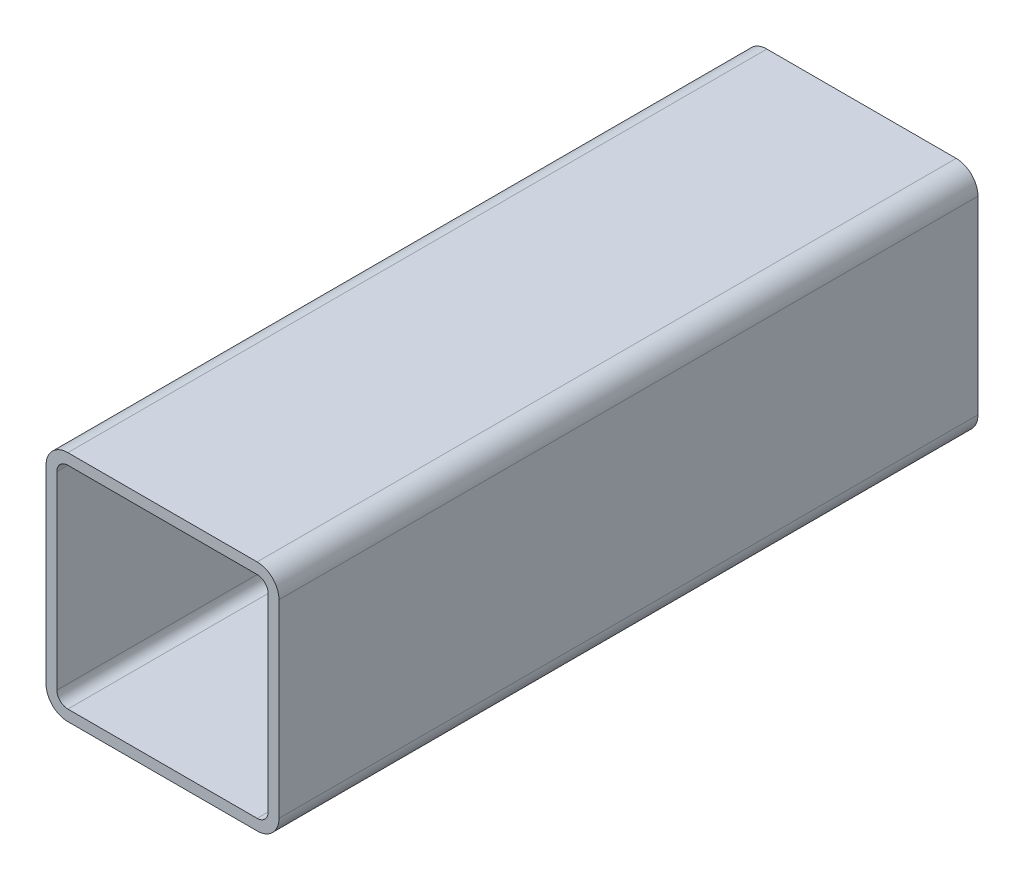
ISO-10303-21;
HEADER;
FILE_DESCRIPTION(('STEP AP214'),'2;1');
FILE_NAME('part.step','',(''),(''),'','','');
FILE_SCHEMA(('AUTOMOTIVE_DESIGN { 1 0 10303 214 1 1 1 1 }'));
ENDSEC;
DATA;
#1=APPLICATION_CONTEXT('core data for automotive mechanical design processes');
#2=APPLICATION_PROTOCOL_DEFINITION('international standard','automotive_design',2000,#1);
#3=PRODUCT_CONTEXT('',#1,'mechanical');
#4=PRODUCT('Part','Part','',(#3));
#5=PRODUCT_RELATED_PRODUCT_CATEGORY('part','',(#4));
#6=PRODUCT_DEFINITION_FORMATION('','',#4);
#7=PRODUCT_DEFINITION_CONTEXT('part definition',#1,'design');
#8=PRODUCT_DEFINITION('design','',#6,#7);
#9=PRODUCT_DEFINITION_SHAPE('','',#8);
#10=(LENGTH_UNIT() NAMED_UNIT(*) SI_UNIT(.MILLI.,.METRE.));
#11=(NAMED_UNIT(*) PLANE_ANGLE_UNIT() SI_UNIT($,.RADIAN.));
#12=(NAMED_UNIT(*) SI_UNIT($,.STERADIAN.) SOLID_ANGLE_UNIT());
#13=UNCERTAINTY_MEASURE_WITH_UNIT(LENGTH_MEASURE(1.E-05),#10,'distance_accuracy_value','');
#14=(GEOMETRIC_REPRESENTATION_CONTEXT(3) GLOBAL_UNCERTAINTY_ASSIGNED_CONTEXT((#13)) GLOBAL_UNIT_ASSIGNED_CONTEXT((#10,
#11,#12)) REPRESENTATION_CONTEXT('',''));
#15=CARTESIAN_POINT('',(0.,0.,0.));
#16=DIRECTION('',(0.,0.,1.));
#17=DIRECTION('',(1.,0.,0.));
#18=AXIS2_PLACEMENT_3D('',#15,#16,#17);
#19=CARTESIAN_POINT('',(11.2001778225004,94.1327651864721,304.8));
#20=DIRECTION('',(0.,0.,1.));
#21=DIRECTION('',(1.,0.,0.));
#22=AXIS2_PLACEMENT_3D('',#19,#20,#21);
#23=PLANE('',#22);
#24=CARTESIAN_POINT('',(11.2001778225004,94.1327651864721,304.8));
#25=DIRECTION('',(0.,0.,1.));
#26=DIRECTION('',(1.,0.,0.));
#27=AXIS2_PLACEMENT_3D('',#24,#25,#26);
#28=CIRCLE('',#27,9.52499999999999);
#29=CARTESIAN_POINT('',(11.2001778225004,103.657765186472,304.8));
#30=VERTEX_POINT('',#29);
#31=CARTESIAN_POINT('',(1.67517782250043,94.1327651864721,304.8));
#32=VERTEX_POINT('',#31);
#33=EDGE_CURVE('E211',#30,#32,#28,.T.);
#34=ORIENTED_EDGE('',*,*,#33,.T.);
#35=DIRECTION('',(0.,-1.,0.));
#36=VECTOR('',#35,1.);
#37=CARTESIAN_POINT('',(1.67517782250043,11.5827651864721,304.8));
#38=LINE('',#37,#36);
#39=CARTESIAN_POINT('',(1.67517782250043,11.5827651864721,304.8));
#40=VERTEX_POINT('',#39);
#41=EDGE_CURVE('E214',#32,#40,#38,.T.);
#42=ORIENTED_EDGE('',*,*,#41,.T.);
#43=CARTESIAN_POINT('',(11.2001778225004,11.5827651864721,304.8));
#44=DIRECTION('',(0.,0.,1.));
#45=DIRECTION('',(1.,0.,0.));
#46=AXIS2_PLACEMENT_3D('',#43,#44,#45);
#47=CIRCLE('',#46,9.52499999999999);
#48=CARTESIAN_POINT('',(11.2001778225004,2.05776518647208,304.8));
#49=VERTEX_POINT('',#48);
#50=EDGE_CURVE('E217',#40,#49,#47,.T.);
#51=ORIENTED_EDGE('',*,*,#50,.T.);
#52=DIRECTION('',(1.,0.,0.));
#53=VECTOR('',#52,1.);
#54=CARTESIAN_POINT('',(93.7501778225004,2.05776518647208,304.8));
#55=LINE('',#54,#53);
#56=CARTESIAN_POINT('',(93.7501778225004,2.05776518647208,304.8));
#57=VERTEX_POINT('',#56);
#58=EDGE_CURVE('E219',#49,#57,#55,.T.);
#59=ORIENTED_EDGE('',*,*,#58,.T.);
#60=CARTESIAN_POINT('',(93.7501778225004,11.5827651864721,304.8));
#61=DIRECTION('',(0.,0.,1.));
#62=DIRECTION('',(1.,0.,0.));
#63=AXIS2_PLACEMENT_3D('',#60,#61,#62);
#64=CIRCLE('',#63,9.525);
#65=CARTESIAN_POINT('',(103.2751778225,11.5827651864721,304.8));
#66=VERTEX_POINT('',#65);
#67=EDGE_CURVE('E221',#57,#66,#64,.T.);
#68=ORIENTED_EDGE('',*,*,#67,.T.);
#69=DIRECTION('',(0.,1.,0.));
#70=VECTOR('',#69,1.);
#71=CARTESIAN_POINT('',(103.2751778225,94.1327651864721,304.8));
#72=LINE('',#71,#70);
#73=CARTESIAN_POINT('',(103.2751778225,94.1327651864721,304.8));
#74=VERTEX_POINT('',#73);
#75=EDGE_CURVE('E223',#66,#74,#72,.T.);
#76=ORIENTED_EDGE('',*,*,#75,.T.);
#77=CARTESIAN_POINT('',(93.7501778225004,94.1327651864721,304.8));
#78=DIRECTION('',(0.,0.,1.));
#79=DIRECTION('',(1.,0.,0.));
#80=AXIS2_PLACEMENT_3D('',#77,#78,#79);
#81=CIRCLE('',#80,9.525);
#82=CARTESIAN_POINT('',(93.7501778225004,103.657765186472,304.8));
#83=VERTEX_POINT('',#82);
#84=EDGE_CURVE('E225',#74,#83,#81,.T.);
#85=ORIENTED_EDGE('',*,*,#84,.T.);
#86=DIRECTION('',(-1.,0.,0.));
#87=VECTOR('',#86,1.);
#88=CARTESIAN_POINT('',(11.2001778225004,103.657765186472,304.8));
#89=LINE('',#88,#87);
#90=EDGE_CURVE('E227',#83,#30,#89,.T.);
#91=ORIENTED_EDGE('',*,*,#90,.T.);
#92=EDGE_LOOP('',(#34,#42,#51,#59,#68,#76,#85,#91));
#93=FACE_BOUND('',#92,.T.);
#94=DIRECTION('',(0.,-1.,0.));
#95=VECTOR('',#94,1.);
#96=CARTESIAN_POINT('',(6.43767782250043,11.5827651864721,304.8));
#97=LINE('',#96,#95);
#98=CARTESIAN_POINT('',(6.43767782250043,94.1327651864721,304.8));
#99=VERTEX_POINT('',#98);
#100=CARTESIAN_POINT('',(6.43767782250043,11.5827651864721,304.8));
#101=VERTEX_POINT('',#100);
#102=EDGE_CURVE('E154',#99,#101,#97,.T.);
#103=ORIENTED_EDGE('',*,*,#102,.F.);
#104=CARTESIAN_POINT('',(11.2001778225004,94.1327651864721,304.8));
#105=DIRECTION('',(0.,0.,1.));
#106=DIRECTION('',(1.,0.,0.));
#107=AXIS2_PLACEMENT_3D('',#104,#105,#106);
#108=CIRCLE('',#107,4.76249999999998);
#109=CARTESIAN_POINT('',(11.2001778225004,98.8952651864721,304.8));
#110=VERTEX_POINT('',#109);
#111=EDGE_CURVE('E146',#110,#99,#108,.T.);
#112=ORIENTED_EDGE('',*,*,#111,.F.);
#113=DIRECTION('',(-1.,0.,0.));
#114=VECTOR('',#113,1.);
#115=CARTESIAN_POINT('',(11.2001778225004,98.8952651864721,304.8));
#116=LINE('',#115,#114);
#117=CARTESIAN_POINT('',(93.7501778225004,98.8952651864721,304.8));
#118=VERTEX_POINT('',#117);
#119=EDGE_CURVE('E179',#118,#110,#116,.T.);
#120=ORIENTED_EDGE('',*,*,#119,.F.);
#121=CARTESIAN_POINT('',(93.7501778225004,94.1327651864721,304.8));
#122=DIRECTION('',(0.,0.,1.));
#123=DIRECTION('',(1.,0.,0.));
#124=AXIS2_PLACEMENT_3D('',#121,#122,#123);
#125=CIRCLE('',#124,4.76249999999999);
#126=CARTESIAN_POINT('',(98.5126778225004,94.1327651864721,304.8));
#127=VERTEX_POINT('',#126);
#128=EDGE_CURVE('E177',#127,#118,#125,.T.);
#129=ORIENTED_EDGE('',*,*,#128,.F.);
#130=DIRECTION('',(0.,1.,0.));
#131=VECTOR('',#130,1.);
#132=CARTESIAN_POINT('',(98.5126778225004,94.1327651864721,304.8));
#133=LINE('',#132,#131);
#134=CARTESIAN_POINT('',(98.5126778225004,11.5827651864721,304.8));
#135=VERTEX_POINT('',#134);
#136=EDGE_CURVE('E175',#135,#127,#133,.T.);
#137=ORIENTED_EDGE('',*,*,#136,.F.);
#138=CARTESIAN_POINT('',(93.7501778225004,11.5827651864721,304.8));
#139=DIRECTION('',(0.,0.,1.));
#140=DIRECTION('',(1.,0.,0.));
#141=AXIS2_PLACEMENT_3D('',#138,#139,#140);
#142=CIRCLE('',#141,4.76249999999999);
#143=CARTESIAN_POINT('',(93.7501778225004,6.82026518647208,304.8));
#144=VERTEX_POINT('',#143);
#145=EDGE_CURVE('E173',#144,#135,#142,.T.);
#146=ORIENTED_EDGE('',*,*,#145,.F.);
#147=DIRECTION('',(1.,0.,0.));
#148=VECTOR('',#147,1.);
#149=CARTESIAN_POINT('',(93.7501778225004,6.82026518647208,304.8));
#150=LINE('',#149,#148);
#151=CARTESIAN_POINT('',(11.2001778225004,6.82026518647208,304.8));
#152=VERTEX_POINT('',#151);
#153=EDGE_CURVE('E169',#152,#144,#150,.T.);
#154=ORIENTED_EDGE('',*,*,#153,.F.);
#155=CARTESIAN_POINT('',(11.2001778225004,11.5827651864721,304.8));
#156=DIRECTION('',(0.,0.,1.));
#157=DIRECTION('',(1.,0.,0.));
#158=AXIS2_PLACEMENT_3D('',#155,#156,#157);
#159=CIRCLE('',#158,4.76249999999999);
#160=EDGE_CURVE('E167',#101,#152,#159,.T.);
#161=ORIENTED_EDGE('',*,*,#160,.F.);
#162=EDGE_LOOP('',(#103,#112,#120,#129,#137,#146,#154,#161));
#163=FACE_BOUND('',#162,.T.);
#164=ADVANCED_FACE('F33',(#93,#163),#23,.T.);
#165=CARTESIAN_POINT('',(11.2001778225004,94.1327651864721,0.));
#166=DIRECTION('',(0.,0.,1.));
#167=DIRECTION('',(1.,0.,0.));
#168=AXIS2_PLACEMENT_3D('',#165,#166,#167);
#169=PLANE('',#168);
#170=CARTESIAN_POINT('',(11.2001778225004,94.1327651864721,0.));
#171=DIRECTION('',(0.,0.,1.));
#172=DIRECTION('',(1.,0.,0.));
#173=AXIS2_PLACEMENT_3D('',#170,#171,#172);
#174=CIRCLE('',#173,9.52499999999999);
#175=CARTESIAN_POINT('',(11.2001778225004,103.657765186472,0.));
#176=VERTEX_POINT('',#175);
#177=CARTESIAN_POINT('',(1.67517782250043,94.1327651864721,0.));
#178=VERTEX_POINT('',#177);
#179=EDGE_CURVE('E162',#176,#178,#174,.T.);
#180=ORIENTED_EDGE('',*,*,#179,.F.);
#181=DIRECTION('',(-1.,0.,0.));
#182=VECTOR('',#181,1.);
#183=CARTESIAN_POINT('',(11.2001778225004,103.657765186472,0.));
#184=LINE('',#183,#182);
#185=CARTESIAN_POINT('',(93.7501778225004,103.657765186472,0.));
#186=VERTEX_POINT('',#185);
#187=EDGE_CURVE('E215',#186,#176,#184,.T.);
#188=ORIENTED_EDGE('',*,*,#187,.F.);
#189=CARTESIAN_POINT('',(93.7501778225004,94.1327651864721,0.));
#190=DIRECTION('',(0.,0.,1.));
#191=DIRECTION('',(1.,0.,0.));
#192=AXIS2_PLACEMENT_3D('',#189,#190,#191);
#193=CIRCLE('',#192,9.525);
#194=CARTESIAN_POINT('',(103.2751778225,94.1327651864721,0.));
#195=VERTEX_POINT('',#194);
#196=EDGE_CURVE('E242',#195,#186,#193,.T.);
#197=ORIENTED_EDGE('',*,*,#196,.F.);
#198=DIRECTION('',(0.,1.,0.));
#199=VECTOR('',#198,1.);
#200=CARTESIAN_POINT('',(103.2751778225,94.1327651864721,0.));
#201=LINE('',#200,#199);
#202=CARTESIAN_POINT('',(103.2751778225,11.5827651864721,0.));
#203=VERTEX_POINT('',#202);
#204=EDGE_CURVE('E240',#203,#195,#201,.T.);
#205=ORIENTED_EDGE('',*,*,#204,.F.);
#206=CARTESIAN_POINT('',(93.7501778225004,11.5827651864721,0.));
#207=DIRECTION('',(0.,0.,1.));
#208=DIRECTION('',(1.,0.,0.));
#209=AXIS2_PLACEMENT_3D('',#206,#207,#208);
#210=CIRCLE('',#209,9.525);
#211=CARTESIAN_POINT('',(93.7501778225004,2.05776518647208,0.));
#212=VERTEX_POINT('',#211);
#213=EDGE_CURVE('E238',#212,#203,#210,.T.);
#214=ORIENTED_EDGE('',*,*,#213,.F.);
#215=DIRECTION('',(1.,0.,0.));
#216=VECTOR('',#215,1.);
#217=CARTESIAN_POINT('',(93.7501778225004,2.05776518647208,0.));
#218=LINE('',#217,#216);
#219=CARTESIAN_POINT('',(11.2001778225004,2.05776518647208,0.));
#220=VERTEX_POINT('',#219);
#221=EDGE_CURVE('E236',#220,#212,#218,.T.);
#222=ORIENTED_EDGE('',*,*,#221,.F.);
#223=CARTESIAN_POINT('',(11.2001778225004,11.5827651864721,0.));
#224=DIRECTION('',(0.,0.,1.));
#225=DIRECTION('',(1.,0.,0.));
#226=AXIS2_PLACEMENT_3D('',#223,#224,#225);
#227=CIRCLE('',#226,9.52499999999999);
#228=CARTESIAN_POINT('',(1.67517782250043,11.5827651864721,0.));
#229=VERTEX_POINT('',#228);
#230=EDGE_CURVE('E234',#229,#220,#227,.T.);
#231=ORIENTED_EDGE('',*,*,#230,.F.);
#232=DIRECTION('',(0.,-1.,0.));
#233=VECTOR('',#232,1.);
#234=CARTESIAN_POINT('',(1.67517782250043,11.5827651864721,0.));
#235=LINE('',#234,#233);
#236=EDGE_CURVE('E232',#178,#229,#235,.T.);
#237=ORIENTED_EDGE('',*,*,#236,.F.);
#238=EDGE_LOOP('',(#180,#188,#197,#205,#214,#222,#231,#237));
#239=FACE_BOUND('',#238,.T.);
#240=CARTESIAN_POINT('',(11.2001778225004,94.1327651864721,0.));
#241=DIRECTION('',(0.,0.,1.));
#242=DIRECTION('',(1.,0.,0.));
#243=AXIS2_PLACEMENT_3D('',#240,#241,#242);
#244=CIRCLE('',#243,4.76249999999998);
#245=CARTESIAN_POINT('',(11.2001778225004,98.8952651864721,0.));
#246=VERTEX_POINT('',#245);
#247=CARTESIAN_POINT('',(6.43767782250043,94.1327651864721,0.));
#248=VERTEX_POINT('',#247);
#249=EDGE_CURVE('E56',#246,#248,#244,.T.);
#250=ORIENTED_EDGE('',*,*,#249,.T.);
#251=DIRECTION('',(0.,-1.,0.));
#252=VECTOR('',#251,1.);
#253=CARTESIAN_POINT('',(6.43767782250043,11.5827651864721,0.));
#254=LINE('',#253,#252);
#255=CARTESIAN_POINT('',(6.43767782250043,11.5827651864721,0.));
#256=VERTEX_POINT('',#255);
#257=EDGE_CURVE('E161',#248,#256,#254,.T.);
#258=ORIENTED_EDGE('',*,*,#257,.T.);
#259=CARTESIAN_POINT('',(11.2001778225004,11.5827651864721,0.));
#260=DIRECTION('',(0.,0.,1.));
#261=DIRECTION('',(1.,0.,0.));
#262=AXIS2_PLACEMENT_3D('',#259,#260,#261);
#263=CIRCLE('',#262,4.76249999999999);
#264=CARTESIAN_POINT('',(11.2001778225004,6.82026518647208,0.));
#265=VERTEX_POINT('',#264);
#266=EDGE_CURVE('E183',#256,#265,#263,.T.);
#267=ORIENTED_EDGE('',*,*,#266,.T.);
#268=DIRECTION('',(1.,0.,0.));
#269=VECTOR('',#268,1.);
#270=CARTESIAN_POINT('',(93.7501778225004,6.82026518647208,0.));
#271=LINE('',#270,#269);
#272=CARTESIAN_POINT('',(93.7501778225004,6.82026518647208,0.));
#273=VERTEX_POINT('',#272);
#274=EDGE_CURVE('E186',#265,#273,#271,.T.);
#275=ORIENTED_EDGE('',*,*,#274,.T.);
#276=CARTESIAN_POINT('',(93.7501778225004,11.5827651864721,0.));
#277=DIRECTION('',(0.,0.,1.));
#278=DIRECTION('',(1.,0.,0.));
#279=AXIS2_PLACEMENT_3D('',#276,#277,#278);
#280=CIRCLE('',#279,4.76249999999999);
#281=CARTESIAN_POINT('',(98.5126778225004,11.5827651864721,0.));
#282=VERTEX_POINT('',#281);
#283=EDGE_CURVE('E189',#273,#282,#280,.T.);
#284=ORIENTED_EDGE('',*,*,#283,.T.);
#285=DIRECTION('',(0.,1.,0.));
#286=VECTOR('',#285,1.);
#287=CARTESIAN_POINT('',(98.5126778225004,94.1327651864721,0.));
#288=LINE('',#287,#286);
#289=CARTESIAN_POINT('',(98.5126778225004,94.1327651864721,0.));
#290=VERTEX_POINT('',#289);
#291=EDGE_CURVE('E192',#282,#290,#288,.T.);
#292=ORIENTED_EDGE('',*,*,#291,.T.);
#293=CARTESIAN_POINT('',(93.7501778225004,94.1327651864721,0.));
#294=DIRECTION('',(0.,0.,1.));
#295=DIRECTION('',(1.,0.,0.));
#296=AXIS2_PLACEMENT_3D('',#293,#294,#295);
#297=CIRCLE('',#296,4.76249999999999);
#298=CARTESIAN_POINT('',(93.7501778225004,98.8952651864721,0.));
#299=VERTEX_POINT('',#298);
#300=EDGE_CURVE('E195',#290,#299,#297,.T.);
#301=ORIENTED_EDGE('',*,*,#300,.T.);
#302=DIRECTION('',(-1.,0.,0.));
#303=VECTOR('',#302,1.);
#304=CARTESIAN_POINT('',(11.2001778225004,98.8952651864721,0.));
#305=LINE('',#304,#303);
#306=EDGE_CURVE('E155',#299,#246,#305,.T.);
#307=ORIENTED_EDGE('',*,*,#306,.T.);
#308=EDGE_LOOP('',(#250,#258,#267,#275,#284,#292,#301,#307));
#309=FACE_BOUND('',#308,.T.);
#310=ADVANCED_FACE('F272',(#239,#309),#169,.F.);
#311=CARTESIAN_POINT('',(11.2001778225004,94.1327651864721,304.8));
#312=DIRECTION('',(0.,0.,-1.));
#313=DIRECTION('',(-1.,0.,0.));
#314=AXIS2_PLACEMENT_3D('',#311,#312,#313);
#315=CYLINDRICAL_SURFACE('',#314,9.52499999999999);
#316=ORIENTED_EDGE('',*,*,#179,.T.);
#317=DIRECTION('',(0.,0.,-1.));
#318=VECTOR('',#317,1.);
#319=CARTESIAN_POINT('',(1.67517782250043,94.1327651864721,304.8));
#320=LINE('',#319,#318);
#321=EDGE_CURVE('E11',#32,#178,#320,.T.);
#322=ORIENTED_EDGE('',*,*,#321,.F.);
#323=ORIENTED_EDGE('',*,*,#33,.F.);
#324=DIRECTION('',(0.,0.,-1.));
#325=VECTOR('',#324,1.);
#326=CARTESIAN_POINT('',(11.2001778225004,103.657765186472,304.8));
#327=LINE('',#326,#325);
#328=EDGE_CURVE('E229',#30,#176,#327,.T.);
#329=ORIENTED_EDGE('',*,*,#328,.T.);
#330=EDGE_LOOP('',(#316,#322,#323,#329));
#331=FACE_BOUND('',#330,.T.);
#332=ADVANCED_FACE('F35',(#331),#315,.T.);
#333=CARTESIAN_POINT('',(1.67517782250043,11.5827651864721,304.8));
#334=DIRECTION('',(1.,0.,0.));
#335=DIRECTION('',(0.,0.,-1.));
#336=AXIS2_PLACEMENT_3D('',#333,#334,#335);
#337=PLANE('',#336);
#338=ORIENTED_EDGE('',*,*,#236,.T.);
#339=DIRECTION('',(0.,0.,-1.));
#340=VECTOR('',#339,1.);
#341=CARTESIAN_POINT('',(1.67517782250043,11.5827651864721,304.8));
#342=LINE('',#341,#340);
#343=EDGE_CURVE('E41',#40,#229,#342,.T.);
#344=ORIENTED_EDGE('',*,*,#343,.F.);
#345=ORIENTED_EDGE('',*,*,#41,.F.);
#346=ORIENTED_EDGE('',*,*,#321,.T.);
#347=EDGE_LOOP('',(#338,#344,#345,#346));
#348=FACE_BOUND('',#347,.T.);
#349=ADVANCED_FACE('F289',(#348),#337,.F.);
#350=CARTESIAN_POINT('',(11.2001778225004,11.5827651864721,304.8));
#351=DIRECTION('',(0.,0.,-1.));
#352=DIRECTION('',(-1.,0.,0.));
#353=AXIS2_PLACEMENT_3D('',#350,#351,#352);
#354=CYLINDRICAL_SURFACE('',#353,9.52499999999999);
#355=ORIENTED_EDGE('',*,*,#230,.T.);
#356=DIRECTION('',(0.,0.,-1.));
#357=VECTOR('',#356,1.);
#358=CARTESIAN_POINT('',(11.2001778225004,2.05776518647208,304.8));
#359=LINE('',#358,#357);
#360=EDGE_CURVE('E259',#49,#220,#359,.T.);
#361=ORIENTED_EDGE('',*,*,#360,.F.);
#362=ORIENTED_EDGE('',*,*,#50,.F.);
#363=ORIENTED_EDGE('',*,*,#343,.T.);
#364=EDGE_LOOP('',(#355,#361,#362,#363));
#365=FACE_BOUND('',#364,.T.);
#366=ADVANCED_FACE('F266',(#365),#354,.T.);
#367=CARTESIAN_POINT('',(93.7501778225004,2.05776518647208,304.8));
#368=DIRECTION('',(0.,1.,0.));
#369=DIRECTION('',(0.,0.,1.));
#370=AXIS2_PLACEMENT_3D('',#367,#368,#369);
#371=PLANE('',#370);
#372=ORIENTED_EDGE('',*,*,#221,.T.);
#373=DIRECTION('',(0.,0.,-1.));
#374=VECTOR('',#373,1.);
#375=CARTESIAN_POINT('',(93.7501778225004,2.05776518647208,304.8));
#376=LINE('',#375,#374);
#377=EDGE_CURVE('E256',#57,#212,#376,.T.);
#378=ORIENTED_EDGE('',*,*,#377,.F.);
#379=ORIENTED_EDGE('',*,*,#58,.F.);
#380=ORIENTED_EDGE('',*,*,#360,.T.);
#381=EDGE_LOOP('',(#372,#378,#379,#380));
#382=FACE_BOUND('',#381,.T.);
#383=ADVANCED_FACE('F278',(#382),#371,.F.);
#384=CARTESIAN_POINT('',(93.7501778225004,11.5827651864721,304.8));
#385=DIRECTION('',(0.,0.,-1.));
#386=DIRECTION('',(-1.,0.,0.));
#387=AXIS2_PLACEMENT_3D('',#384,#385,#386);
#388=CYLINDRICAL_SURFACE('',#387,9.525);
#389=ORIENTED_EDGE('',*,*,#213,.T.);
#390=DIRECTION('',(0.,0.,-1.));
#391=VECTOR('',#390,1.);
#392=CARTESIAN_POINT('',(103.2751778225,11.5827651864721,304.8));
#393=LINE('',#392,#391);
#394=EDGE_CURVE('E253',#66,#203,#393,.T.);
#395=ORIENTED_EDGE('',*,*,#394,.F.);
#396=ORIENTED_EDGE('',*,*,#67,.F.);
#397=ORIENTED_EDGE('',*,*,#377,.T.);
#398=EDGE_LOOP('',(#389,#395,#396,#397));
#399=FACE_BOUND('',#398,.T.);
#400=ADVANCED_FACE('F282',(#399),#388,.T.);
#401=CARTESIAN_POINT('',(103.2751778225,94.1327651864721,304.8));
#402=DIRECTION('',(-1.,0.,0.));
#403=DIRECTION('',(0.,0.,1.));
#404=AXIS2_PLACEMENT_3D('',#401,#402,#403);
#405=PLANE('',#404);
#406=ORIENTED_EDGE('',*,*,#204,.T.);
#407=DIRECTION('',(0.,0.,-1.));
#408=VECTOR('',#407,1.);
#409=CARTESIAN_POINT('',(103.2751778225,94.1327651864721,304.8));
#410=LINE('',#409,#408);
#411=EDGE_CURVE('E250',#74,#195,#410,.T.);
#412=ORIENTED_EDGE('',*,*,#411,.F.);
#413=ORIENTED_EDGE('',*,*,#75,.F.);
#414=ORIENTED_EDGE('',*,*,#394,.T.);
#415=EDGE_LOOP('',(#406,#412,#413,#414));
#416=FACE_BOUND('',#415,.T.);
#417=ADVANCED_FACE('F302',(#416),#405,.F.);
#418=CARTESIAN_POINT('',(93.7501778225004,94.1327651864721,304.8));
#419=DIRECTION('',(0.,0.,-1.));
#420=DIRECTION('',(-1.,0.,0.));
#421=AXIS2_PLACEMENT_3D('',#418,#419,#420);
#422=CYLINDRICAL_SURFACE('',#421,9.525);
#423=ORIENTED_EDGE('',*,*,#196,.T.);
#424=DIRECTION('',(0.,0.,-1.));
#425=VECTOR('',#424,1.);
#426=CARTESIAN_POINT('',(93.7501778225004,103.657765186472,304.8));
#427=LINE('',#426,#425);
#428=EDGE_CURVE('E247',#83,#186,#427,.T.);
#429=ORIENTED_EDGE('',*,*,#428,.F.);
#430=ORIENTED_EDGE('',*,*,#84,.F.);
#431=ORIENTED_EDGE('',*,*,#411,.T.);
#432=EDGE_LOOP('',(#423,#429,#430,#431));
#433=FACE_BOUND('',#432,.T.);
#434=ADVANCED_FACE('F300',(#433),#422,.T.);
#435=CARTESIAN_POINT('',(11.2001778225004,103.657765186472,304.8));
#436=DIRECTION('',(0.,-1.,0.));
#437=DIRECTION('',(0.,0.,-1.));
#438=AXIS2_PLACEMENT_3D('',#435,#436,#437);
#439=PLANE('',#438);
#440=ORIENTED_EDGE('',*,*,#187,.T.);
#441=ORIENTED_EDGE('',*,*,#328,.F.);
#442=ORIENTED_EDGE('',*,*,#90,.F.);
#443=ORIENTED_EDGE('',*,*,#428,.T.);
#444=EDGE_LOOP('',(#440,#441,#442,#443));
#445=FACE_BOUND('',#444,.T.);
#446=ADVANCED_FACE('F295',(#445),#439,.F.);
#447=CARTESIAN_POINT('',(11.2001778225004,94.1327651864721,304.8));
#448=DIRECTION('',(0.,0.,-1.));
#449=DIRECTION('',(-1.,0.,0.));
#450=AXIS2_PLACEMENT_3D('',#447,#448,#449);
#451=CYLINDRICAL_SURFACE('',#450,4.76249999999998);
#452=ORIENTED_EDGE('',*,*,#249,.F.);
#453=DIRECTION('',(0.,0.,-1.));
#454=VECTOR('',#453,1.);
#455=CARTESIAN_POINT('',(11.2001778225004,98.8952651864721,304.8));
#456=LINE('',#455,#454);
#457=EDGE_CURVE('E150',#110,#246,#456,.T.);
#458=ORIENTED_EDGE('',*,*,#457,.F.);
#459=ORIENTED_EDGE('',*,*,#111,.T.);
#460=DIRECTION('',(0.,0.,-1.));
#461=VECTOR('',#460,1.);
#462=CARTESIAN_POINT('',(6.43767782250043,94.1327651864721,304.8));
#463=LINE('',#462,#461);
#464=EDGE_CURVE('E149',#99,#248,#463,.T.);
#465=ORIENTED_EDGE('',*,*,#464,.T.);
#466=EDGE_LOOP('',(#452,#458,#459,#465));
#467=FACE_BOUND('',#466,.T.);
#468=ADVANCED_FACE('F148',(#467),#451,.F.);
#469=CARTESIAN_POINT('',(6.43767782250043,11.5827651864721,304.8));
#470=DIRECTION('',(1.,0.,0.));
#471=DIRECTION('',(0.,0.,-1.));
#472=AXIS2_PLACEMENT_3D('',#469,#470,#471);
#473=PLANE('',#472);
#474=ORIENTED_EDGE('',*,*,#257,.F.);
#475=ORIENTED_EDGE('',*,*,#464,.F.);
#476=ORIENTED_EDGE('',*,*,#102,.T.);
#477=DIRECTION('',(0.,0.,-1.));
#478=VECTOR('',#477,1.);
#479=CARTESIAN_POINT('',(6.43767782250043,11.5827651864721,304.8));
#480=LINE('',#479,#478);
#481=EDGE_CURVE('E163',#101,#256,#480,.T.);
#482=ORIENTED_EDGE('',*,*,#481,.T.);
#483=EDGE_LOOP('',(#474,#475,#476,#482));
#484=FACE_BOUND('',#483,.T.);
#485=ADVANCED_FACE('F158',(#484),#473,.T.);
#486=CARTESIAN_POINT('',(11.2001778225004,11.5827651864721,304.8));
#487=DIRECTION('',(0.,0.,-1.));
#488=DIRECTION('',(-1.,0.,0.));
#489=AXIS2_PLACEMENT_3D('',#486,#487,#488);
#490=CYLINDRICAL_SURFACE('',#489,4.76249999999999);
#491=ORIENTED_EDGE('',*,*,#266,.F.);
#492=ORIENTED_EDGE('',*,*,#481,.F.);
#493=ORIENTED_EDGE('',*,*,#160,.T.);
#494=DIRECTION('',(0.,0.,-1.));
#495=VECTOR('',#494,1.);
#496=CARTESIAN_POINT('',(11.2001778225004,6.82026518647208,304.8));
#497=LINE('',#496,#495);
#498=EDGE_CURVE('E208',#152,#265,#497,.T.);
#499=ORIENTED_EDGE('',*,*,#498,.T.);
#500=EDGE_LOOP('',(#491,#492,#493,#499));
#501=FACE_BOUND('',#500,.T.);
#502=ADVANCED_FACE('F327',(#501),#490,.F.);
#503=CARTESIAN_POINT('',(93.7501778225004,6.82026518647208,304.8));
#504=DIRECTION('',(0.,1.,0.));
#505=DIRECTION('',(0.,0.,1.));
#506=AXIS2_PLACEMENT_3D('',#503,#504,#505);
#507=PLANE('',#506);
#508=ORIENTED_EDGE('',*,*,#274,.F.);
#509=ORIENTED_EDGE('',*,*,#498,.F.);
#510=ORIENTED_EDGE('',*,*,#153,.T.);
#511=DIRECTION('',(0.,0.,-1.));
#512=VECTOR('',#511,1.);
#513=CARTESIAN_POINT('',(93.7501778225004,6.82026518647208,304.8));
#514=LINE('',#513,#512);
#515=EDGE_CURVE('E206',#144,#273,#514,.T.);
#516=ORIENTED_EDGE('',*,*,#515,.T.);
#517=EDGE_LOOP('',(#508,#509,#510,#516));
#518=FACE_BOUND('',#517,.T.);
#519=ADVANCED_FACE('F331',(#518),#507,.T.);
#520=CARTESIAN_POINT('',(93.7501778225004,11.5827651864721,304.8));
#521=DIRECTION('',(0.,0.,-1.));
#522=DIRECTION('',(-1.,0.,0.));
#523=AXIS2_PLACEMENT_3D('',#520,#521,#522);
#524=CYLINDRICAL_SURFACE('',#523,4.76249999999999);
#525=ORIENTED_EDGE('',*,*,#283,.F.);
#526=ORIENTED_EDGE('',*,*,#515,.F.);
#527=ORIENTED_EDGE('',*,*,#145,.T.);
#528=DIRECTION('',(0.,0.,-1.));
#529=VECTOR('',#528,1.);
#530=CARTESIAN_POINT('',(98.5126778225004,11.5827651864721,304.8));
#531=LINE('',#530,#529);
#532=EDGE_CURVE('E204',#135,#282,#531,.T.);
#533=ORIENTED_EDGE('',*,*,#532,.T.);
#534=EDGE_LOOP('',(#525,#526,#527,#533));
#535=FACE_BOUND('',#534,.T.);
#536=ADVANCED_FACE('F337',(#535),#524,.F.);
#537=CARTESIAN_POINT('',(98.5126778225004,94.1327651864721,304.8));
#538=DIRECTION('',(-1.,0.,0.));
#539=DIRECTION('',(0.,0.,1.));
#540=AXIS2_PLACEMENT_3D('',#537,#538,#539);
#541=PLANE('',#540);
#542=ORIENTED_EDGE('',*,*,#291,.F.);
#543=ORIENTED_EDGE('',*,*,#532,.F.);
#544=ORIENTED_EDGE('',*,*,#136,.T.);
#545=DIRECTION('',(0.,0.,-1.));
#546=VECTOR('',#545,1.);
#547=CARTESIAN_POINT('',(98.5126778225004,94.1327651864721,304.8));
#548=LINE('',#547,#546);
#549=EDGE_CURVE('E202',#127,#290,#548,.T.);
#550=ORIENTED_EDGE('',*,*,#549,.T.);
#551=EDGE_LOOP('',(#542,#543,#544,#550));
#552=FACE_BOUND('',#551,.T.);
#553=ADVANCED_FACE('F341',(#552),#541,.T.);
#554=CARTESIAN_POINT('',(93.7501778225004,94.1327651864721,304.8));
#555=DIRECTION('',(0.,0.,-1.));
#556=DIRECTION('',(-1.,0.,0.));
#557=AXIS2_PLACEMENT_3D('',#554,#555,#556);
#558=CYLINDRICAL_SURFACE('',#557,4.76249999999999);
#559=ORIENTED_EDGE('',*,*,#300,.F.);
#560=ORIENTED_EDGE('',*,*,#549,.F.);
#561=ORIENTED_EDGE('',*,*,#128,.T.);
#562=DIRECTION('',(0.,0.,-1.));
#563=VECTOR('',#562,1.);
#564=CARTESIAN_POINT('',(93.7501778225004,98.8952651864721,304.8));
#565=LINE('',#564,#563);
#566=EDGE_CURVE('E48',#118,#299,#565,.T.);
#567=ORIENTED_EDGE('',*,*,#566,.T.);
#568=EDGE_LOOP('',(#559,#560,#561,#567));
#569=FACE_BOUND('',#568,.T.);
#570=ADVANCED_FACE('F345',(#569),#558,.F.);
#571=CARTESIAN_POINT('',(11.2001778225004,98.8952651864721,304.8));
#572=DIRECTION('',(0.,-1.,0.));
#573=DIRECTION('',(0.,0.,-1.));
#574=AXIS2_PLACEMENT_3D('',#571,#572,#573);
#575=PLANE('',#574);
#576=ORIENTED_EDGE('',*,*,#306,.F.);
#577=ORIENTED_EDGE('',*,*,#566,.F.);
#578=ORIENTED_EDGE('',*,*,#119,.T.);
#579=ORIENTED_EDGE('',*,*,#457,.T.);
#580=EDGE_LOOP('',(#576,#577,#578,#579));
#581=FACE_BOUND('',#580,.T.);
#582=ADVANCED_FACE('F349',(#581),#575,.T.);
#583=CLOSED_SHELL('',(#164,#310,#332,#349,#366,#383,#400,#417,#434,#446,#468,#485,#502,#519,
#536,#553,#570,#582));
#584=MANIFOLD_SOLID_BREP('B2',#583);
#585=ADVANCED_BREP_SHAPE_REPRESENTATION('',(#18,#584),#14);
#586=SHAPE_DEFINITION_REPRESENTATION(#9,#585);
ENDSEC;
END-ISO-10303-21;
